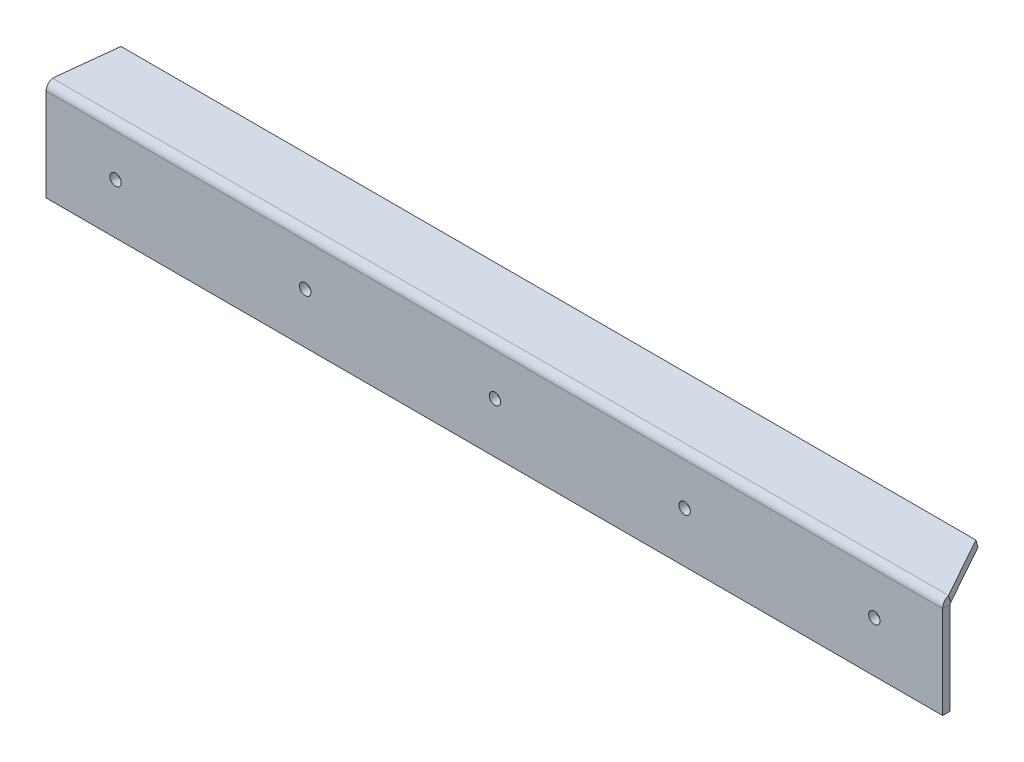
ISO-10303-21;
HEADER;
FILE_DESCRIPTION(('STEP AP214'),'2;1');
FILE_NAME('part.step','',(''),(''),'','','');
FILE_SCHEMA(('AUTOMOTIVE_DESIGN { 1 0 10303 214 1 1 1 1 }'));
ENDSEC;
DATA;
#1=APPLICATION_CONTEXT('core data for automotive mechanical design processes');
#2=APPLICATION_PROTOCOL_DEFINITION('international standard','automotive_design',2000,#1);
#3=PRODUCT_CONTEXT('',#1,'mechanical');
#4=PRODUCT('Part','Part','',(#3));
#5=PRODUCT_RELATED_PRODUCT_CATEGORY('part','',(#4));
#6=PRODUCT_DEFINITION_FORMATION('','',#4);
#7=PRODUCT_DEFINITION_CONTEXT('part definition',#1,'design');
#8=PRODUCT_DEFINITION('design','',#6,#7);
#9=PRODUCT_DEFINITION_SHAPE('','',#8);
#10=(LENGTH_UNIT() NAMED_UNIT(*) SI_UNIT(.MILLI.,.METRE.));
#11=(NAMED_UNIT(*) PLANE_ANGLE_UNIT() SI_UNIT($,.RADIAN.));
#12=(NAMED_UNIT(*) SI_UNIT($,.STERADIAN.) SOLID_ANGLE_UNIT());
#13=UNCERTAINTY_MEASURE_WITH_UNIT(LENGTH_MEASURE(1.E-05),#10,'distance_accuracy_value','');
#14=(GEOMETRIC_REPRESENTATION_CONTEXT(3) GLOBAL_UNCERTAINTY_ASSIGNED_CONTEXT((#13)) GLOBAL_UNIT_ASSIGNED_CONTEXT((#10,
#11,#12)) REPRESENTATION_CONTEXT('',''));
#15=CARTESIAN_POINT('',(0.,0.,0.));
#16=DIRECTION('',(0.,0.,1.));
#17=DIRECTION('',(1.,0.,0.));
#18=AXIS2_PLACEMENT_3D('',#15,#16,#17);
#19=CARTESIAN_POINT('',(-354.5,-80.,6.));
#20=DIRECTION('',(0.,0.,1.));
#21=DIRECTION('',(1.,0.,0.));
#22=AXIS2_PLACEMENT_3D('',#19,#20,#21);
#23=PLANE('',#22);
#24=CARTESIAN_POINT('',(300.5,-40.,6.));
#25=DIRECTION('',(0.,0.,1.));
#26=DIRECTION('',(1.,0.,0.));
#27=AXIS2_PLACEMENT_3D('',#24,#25,#26);
#28=CIRCLE('',#27,4.50000000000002);
#29=CARTESIAN_POINT('',(305.,-40.,6.));
#30=VERTEX_POINT('',#29);
#31=EDGE_CURVE('E327',#30,#30,#28,.T.);
#32=ORIENTED_EDGE('',*,*,#31,.F.);
#33=EDGE_LOOP('',(#32));
#34=FACE_BOUND('',#33,.T.);
#35=CARTESIAN_POINT('',(0.5,-40.,6.));
#36=DIRECTION('',(0.,0.,1.));
#37=DIRECTION('',(1.,0.,0.));
#38=AXIS2_PLACEMENT_3D('',#35,#36,#37);
#39=CIRCLE('',#38,4.50000000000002);
#40=CARTESIAN_POINT('',(5.00000000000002,-40.,6.));
#41=VERTEX_POINT('',#40);
#42=EDGE_CURVE('E316',#41,#41,#39,.T.);
#43=ORIENTED_EDGE('',*,*,#42,.F.);
#44=EDGE_LOOP('',(#43));
#45=FACE_BOUND('',#44,.T.);
#46=CARTESIAN_POINT('',(-299.5,-40.,6.));
#47=DIRECTION('',(0.,0.,1.));
#48=DIRECTION('',(1.,0.,0.));
#49=AXIS2_PLACEMENT_3D('',#46,#47,#48);
#50=CIRCLE('',#49,4.50000000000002);
#51=CARTESIAN_POINT('',(-295.,-40.,6.));
#52=VERTEX_POINT('',#51);
#53=EDGE_CURVE('E303',#52,#52,#50,.T.);
#54=ORIENTED_EDGE('',*,*,#53,.F.);
#55=EDGE_LOOP('',(#54));
#56=FACE_BOUND('',#55,.T.);
#57=CARTESIAN_POINT('',(-149.5,-40.,6.));
#58=DIRECTION('',(0.,0.,1.));
#59=DIRECTION('',(1.,0.,0.));
#60=AXIS2_PLACEMENT_3D('',#57,#58,#59);
#61=CIRCLE('',#60,4.50000000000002);
#62=CARTESIAN_POINT('',(-145.,-40.,6.));
#63=VERTEX_POINT('',#62);
#64=EDGE_CURVE('E310',#63,#63,#61,.T.);
#65=ORIENTED_EDGE('',*,*,#64,.F.);
#66=EDGE_LOOP('',(#65));
#67=FACE_BOUND('',#66,.T.);
#68=CARTESIAN_POINT('',(150.5,-40.,6.));
#69=DIRECTION('',(0.,0.,1.));
#70=DIRECTION('',(1.,0.,0.));
#71=AXIS2_PLACEMENT_3D('',#68,#69,#70);
#72=CIRCLE('',#71,4.50000000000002);
#73=CARTESIAN_POINT('',(155.,-40.,6.));
#74=VERTEX_POINT('',#73);
#75=EDGE_CURVE('E322',#74,#74,#72,.T.);
#76=ORIENTED_EDGE('',*,*,#75,.F.);
#77=EDGE_LOOP('',(#76));
#78=FACE_BOUND('',#77,.T.);
#79=DIRECTION('',(0.,1.,0.));
#80=VECTOR('',#79,1.);
#81=CARTESIAN_POINT('',(354.5,0.,6.));
#82=LINE('',#81,#80);
#83=CARTESIAN_POINT('',(354.5,-80.,6.));
#84=VERTEX_POINT('',#83);
#85=CARTESIAN_POINT('',(354.5,-6.79686452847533,5.99999999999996));
#86=VERTEX_POINT('',#85);
#87=EDGE_CURVE('E292',#84,#86,#82,.T.);
#88=ORIENTED_EDGE('',*,*,#87,.T.);
#89=DIRECTION('',(1.,0.,0.));
#90=VECTOR('',#89,1.);
#91=CARTESIAN_POINT('',(354.5,-6.79686452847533,5.99999999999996));
#92=LINE('',#91,#90);
#93=CARTESIAN_POINT('',(-354.5,-6.79686452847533,6.));
#94=VERTEX_POINT('',#93);
#95=EDGE_CURVE('E183',#86,#94,#92,.F.);
#96=ORIENTED_EDGE('',*,*,#95,.T.);
#97=DIRECTION('',(0.,-1.,0.));
#98=VECTOR('',#97,1.);
#99=CARTESIAN_POINT('',(-354.5,0.,6.));
#100=LINE('',#99,#98);
#101=CARTESIAN_POINT('',(-354.5,-80.,6.));
#102=VERTEX_POINT('',#101);
#103=EDGE_CURVE('E293',#94,#102,#100,.T.);
#104=ORIENTED_EDGE('',*,*,#103,.T.);
#105=DIRECTION('',(1.,0.,0.));
#106=VECTOR('',#105,1.);
#107=CARTESIAN_POINT('',(-354.5,-80.,6.));
#108=LINE('',#107,#106);
#109=EDGE_CURVE('E94',#102,#84,#108,.T.);
#110=ORIENTED_EDGE('',*,*,#109,.T.);
#111=EDGE_LOOP('',(#88,#96,#104,#110));
#112=FACE_BOUND('',#111,.T.);
#113=ADVANCED_FACE('F71',(#34,#45,#56,#67,#78,#112),#23,.T.);
#114=CARTESIAN_POINT('',(-354.5,-80.,0.));
#115=DIRECTION('',(0.,0.,1.));
#116=DIRECTION('',(1.,0.,0.));
#117=AXIS2_PLACEMENT_3D('',#114,#115,#116);
#118=PLANE('',#117);
#119=CARTESIAN_POINT('',(300.5,-40.,0.));
#120=DIRECTION('',(0.,0.,1.));
#121=DIRECTION('',(1.,0.,0.));
#122=AXIS2_PLACEMENT_3D('',#119,#120,#121);
#123=CIRCLE('',#122,4.50000000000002);
#124=CARTESIAN_POINT('',(305.,-40.,0.));
#125=VERTEX_POINT('',#124);
#126=EDGE_CURVE('E189',#125,#125,#123,.T.);
#127=ORIENTED_EDGE('',*,*,#126,.T.);
#128=EDGE_LOOP('',(#127));
#129=FACE_BOUND('',#128,.T.);
#130=CARTESIAN_POINT('',(0.5,-40.,0.));
#131=DIRECTION('',(0.,0.,1.));
#132=DIRECTION('',(1.,0.,0.));
#133=AXIS2_PLACEMENT_3D('',#130,#131,#132);
#134=CIRCLE('',#133,4.50000000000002);
#135=CARTESIAN_POINT('',(5.00000000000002,-40.,0.));
#136=VERTEX_POINT('',#135);
#137=EDGE_CURVE('E319',#136,#136,#134,.T.);
#138=ORIENTED_EDGE('',*,*,#137,.T.);
#139=EDGE_LOOP('',(#138));
#140=FACE_BOUND('',#139,.T.);
#141=CARTESIAN_POINT('',(-299.5,-40.,0.));
#142=DIRECTION('',(0.,0.,1.));
#143=DIRECTION('',(1.,0.,0.));
#144=AXIS2_PLACEMENT_3D('',#141,#142,#143);
#145=CIRCLE('',#144,4.50000000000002);
#146=CARTESIAN_POINT('',(-295.,-40.,0.));
#147=VERTEX_POINT('',#146);
#148=EDGE_CURVE('E305',#147,#147,#145,.T.);
#149=ORIENTED_EDGE('',*,*,#148,.T.);
#150=EDGE_LOOP('',(#149));
#151=FACE_BOUND('',#150,.T.);
#152=CARTESIAN_POINT('',(-149.5,-40.,0.));
#153=DIRECTION('',(0.,0.,1.));
#154=DIRECTION('',(1.,0.,0.));
#155=AXIS2_PLACEMENT_3D('',#152,#153,#154);
#156=CIRCLE('',#155,4.50000000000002);
#157=CARTESIAN_POINT('',(-145.,-40.,0.));
#158=VERTEX_POINT('',#157);
#159=EDGE_CURVE('E313',#158,#158,#156,.T.);
#160=ORIENTED_EDGE('',*,*,#159,.T.);
#161=EDGE_LOOP('',(#160));
#162=FACE_BOUND('',#161,.T.);
#163=CARTESIAN_POINT('',(150.5,-40.,0.));
#164=DIRECTION('',(0.,0.,1.));
#165=DIRECTION('',(1.,0.,0.));
#166=AXIS2_PLACEMENT_3D('',#163,#164,#165);
#167=CIRCLE('',#166,4.50000000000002);
#168=CARTESIAN_POINT('',(155.,-40.,0.));
#169=VERTEX_POINT('',#168);
#170=EDGE_CURVE('E325',#169,#169,#167,.T.);
#171=ORIENTED_EDGE('',*,*,#170,.T.);
#172=EDGE_LOOP('',(#171));
#173=FACE_BOUND('',#172,.T.);
#174=DIRECTION('',(1.,0.,0.));
#175=VECTOR('',#174,1.);
#176=CARTESIAN_POINT('',(354.5,-6.79686452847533,0.));
#177=LINE('',#176,#175);
#178=CARTESIAN_POINT('',(354.5,-6.79686452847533,0.));
#179=VERTEX_POINT('',#178);
#180=CARTESIAN_POINT('',(-354.5,-6.79686452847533,0.));
#181=VERTEX_POINT('',#180);
#182=EDGE_CURVE('E179',#179,#181,#177,.F.);
#183=ORIENTED_EDGE('',*,*,#182,.F.);
#184=DIRECTION('',(0.,1.,0.));
#185=VECTOR('',#184,1.);
#186=CARTESIAN_POINT('',(354.5,0.,0.));
#187=LINE('',#186,#185);
#188=CARTESIAN_POINT('',(354.5,-80.,0.));
#189=VERTEX_POINT('',#188);
#190=EDGE_CURVE('E287',#189,#179,#187,.T.);
#191=ORIENTED_EDGE('',*,*,#190,.F.);
#192=DIRECTION('',(1.,0.,0.));
#193=VECTOR('',#192,1.);
#194=CARTESIAN_POINT('',(-354.5,-80.,0.));
#195=LINE('',#194,#193);
#196=CARTESIAN_POINT('',(-354.5,-80.,0.));
#197=VERTEX_POINT('',#196);
#198=EDGE_CURVE('E280',#197,#189,#195,.T.);
#199=ORIENTED_EDGE('',*,*,#198,.F.);
#200=DIRECTION('',(0.,-1.,0.));
#201=VECTOR('',#200,1.);
#202=CARTESIAN_POINT('',(-354.5,0.,0.));
#203=LINE('',#202,#201);
#204=EDGE_CURVE('E288',#181,#197,#203,.T.);
#205=ORIENTED_EDGE('',*,*,#204,.F.);
#206=EDGE_LOOP('',(#183,#191,#199,#205));
#207=FACE_BOUND('',#206,.T.);
#208=ADVANCED_FACE('F265',(#129,#140,#151,#162,#173,#207),#118,.F.);
#209=CARTESIAN_POINT('',(-354.5,0.,6.));
#210=DIRECTION('',(1.,0.,0.));
#211=DIRECTION('',(0.,1.,0.));
#212=AXIS2_PLACEMENT_3D('',#209,#210,#211);
#213=PLANE('',#212);
#214=DIRECTION('',(0.,0.,1.));
#215=VECTOR('',#214,1.);
#216=CARTESIAN_POINT('',(-354.500000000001,-6.79686452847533,0.));
#217=LINE('',#216,#215);
#218=EDGE_CURVE('E187',#181,#94,#217,.T.);
#219=ORIENTED_EDGE('',*,*,#218,.F.);
#220=ORIENTED_EDGE('',*,*,#204,.T.);
#221=DIRECTION('',(0.,0.,-1.));
#222=VECTOR('',#221,1.);
#223=CARTESIAN_POINT('',(-354.5,-80.,6.));
#224=LINE('',#223,#222);
#225=EDGE_CURVE('E15',#102,#197,#224,.T.);
#226=ORIENTED_EDGE('',*,*,#225,.F.);
#227=ORIENTED_EDGE('',*,*,#103,.F.);
#228=EDGE_LOOP('',(#219,#220,#226,#227));
#229=FACE_BOUND('',#228,.T.);
#230=ADVANCED_FACE('F73',(#229),#213,.F.);
#231=CARTESIAN_POINT('',(354.5,0.,6.));
#232=DIRECTION('',(-1.,0.,0.));
#233=DIRECTION('',(0.,-1.,0.));
#234=AXIS2_PLACEMENT_3D('',#231,#232,#233);
#235=PLANE('',#234);
#236=DIRECTION('',(0.,0.,1.));
#237=VECTOR('',#236,1.);
#238=CARTESIAN_POINT('',(354.5,-6.79686452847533,0.));
#239=LINE('',#238,#237);
#240=EDGE_CURVE('E190',#179,#86,#239,.T.);
#241=ORIENTED_EDGE('',*,*,#240,.T.);
#242=ORIENTED_EDGE('',*,*,#87,.F.);
#243=DIRECTION('',(0.,0.,-1.));
#244=VECTOR('',#243,1.);
#245=CARTESIAN_POINT('',(354.5,-80.,6.));
#246=LINE('',#245,#244);
#247=EDGE_CURVE('E79',#84,#189,#246,.T.);
#248=ORIENTED_EDGE('',*,*,#247,.T.);
#249=ORIENTED_EDGE('',*,*,#190,.T.);
#250=EDGE_LOOP('',(#241,#242,#248,#249));
#251=FACE_BOUND('',#250,.T.);
#252=ADVANCED_FACE('F272',(#251),#235,.F.);
#253=CARTESIAN_POINT('',(-354.5,-80.,6.));
#254=DIRECTION('',(0.,1.,0.));
#255=DIRECTION('',(0.,0.,1.));
#256=AXIS2_PLACEMENT_3D('',#253,#254,#255);
#257=PLANE('',#256);
#258=ORIENTED_EDGE('',*,*,#198,.T.);
#259=ORIENTED_EDGE('',*,*,#247,.F.);
#260=ORIENTED_EDGE('',*,*,#109,.F.);
#261=ORIENTED_EDGE('',*,*,#225,.T.);
#262=EDGE_LOOP('',(#258,#259,#260,#261));
#263=FACE_BOUND('',#262,.T.);
#264=ADVANCED_FACE('F263',(#263),#257,.F.);
#265=CARTESIAN_POINT('',(-299.5,-40.,6.));
#266=DIRECTION('',(0.,0.,-1.));
#267=DIRECTION('',(-1.,0.,0.));
#268=AXIS2_PLACEMENT_3D('',#265,#266,#267);
#269=CYLINDRICAL_SURFACE('',#268,4.50000000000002);
#270=ORIENTED_EDGE('',*,*,#53,.T.);
#271=EDGE_LOOP('',(#270));
#272=FACE_BOUND('',#271,.T.);
#273=ORIENTED_EDGE('',*,*,#148,.F.);
#274=EDGE_LOOP('',(#273));
#275=FACE_BOUND('',#274,.T.);
#276=ADVANCED_FACE('F259',(#272,#275),#269,.F.);
#277=CARTESIAN_POINT('',(-149.5,-40.,6.));
#278=DIRECTION('',(0.,0.,-1.));
#279=DIRECTION('',(-1.,0.,0.));
#280=AXIS2_PLACEMENT_3D('',#277,#278,#279);
#281=CYLINDRICAL_SURFACE('',#280,4.50000000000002);
#282=ORIENTED_EDGE('',*,*,#64,.T.);
#283=EDGE_LOOP('',(#282));
#284=FACE_BOUND('',#283,.T.);
#285=ORIENTED_EDGE('',*,*,#159,.F.);
#286=EDGE_LOOP('',(#285));
#287=FACE_BOUND('',#286,.T.);
#288=ADVANCED_FACE('F255',(#284,#287),#281,.F.);
#289=CARTESIAN_POINT('',(0.5,-40.,6.));
#290=DIRECTION('',(0.,0.,-1.));
#291=DIRECTION('',(-1.,0.,0.));
#292=AXIS2_PLACEMENT_3D('',#289,#290,#291);
#293=CYLINDRICAL_SURFACE('',#292,4.50000000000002);
#294=ORIENTED_EDGE('',*,*,#42,.T.);
#295=EDGE_LOOP('',(#294));
#296=FACE_BOUND('',#295,.T.);
#297=ORIENTED_EDGE('',*,*,#137,.F.);
#298=EDGE_LOOP('',(#297));
#299=FACE_BOUND('',#298,.T.);
#300=ADVANCED_FACE('F251',(#296,#299),#293,.F.);
#301=CARTESIAN_POINT('',(150.5,-40.,6.));
#302=DIRECTION('',(0.,0.,-1.));
#303=DIRECTION('',(-1.,0.,0.));
#304=AXIS2_PLACEMENT_3D('',#301,#302,#303);
#305=CYLINDRICAL_SURFACE('',#304,4.50000000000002);
#306=ORIENTED_EDGE('',*,*,#75,.T.);
#307=EDGE_LOOP('',(#306));
#308=FACE_BOUND('',#307,.T.);
#309=ORIENTED_EDGE('',*,*,#170,.F.);
#310=EDGE_LOOP('',(#309));
#311=FACE_BOUND('',#310,.T.);
#312=ADVANCED_FACE('F247',(#308,#311),#305,.F.);
#313=CARTESIAN_POINT('',(300.5,-40.,6.));
#314=DIRECTION('',(0.,0.,-1.));
#315=DIRECTION('',(-1.,0.,0.));
#316=AXIS2_PLACEMENT_3D('',#313,#314,#315);
#317=CYLINDRICAL_SURFACE('',#316,4.50000000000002);
#318=ORIENTED_EDGE('',*,*,#31,.T.);
#319=EDGE_LOOP('',(#318));
#320=FACE_BOUND('',#319,.T.);
#321=ORIENTED_EDGE('',*,*,#126,.F.);
#322=EDGE_LOOP('',(#321));
#323=FACE_BOUND('',#322,.T.);
#324=ADVANCED_FACE('F238',(#320,#323),#317,.F.);
#325=CARTESIAN_POINT('',(-354.5,-6.79686452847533,6.06000000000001));
#326=CARTESIAN_POINT('',(-354.461789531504,-5.33194822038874,6.06000000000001));
#327=CARTESIAN_POINT('',(-354.42367816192,-3.87498634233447,5.57187207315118));
#328=CARTESIAN_POINT('',(-354.347356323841,-1.53815074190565,3.81094014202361));
#329=CARTESIAN_POINT('',(-354.309244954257,-0.667338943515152,2.54496478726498));
#330=CARTESIAN_POINT('',(-354.271034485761,-0.263553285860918,1.13679685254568));
#331=CARTESIAN_POINT('',(-354.5,-6.79686452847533,6.00000000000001));
#332=CARTESIAN_POINT('',(-354.461789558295,-5.34488052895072,6.00000000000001));
#333=CARTESIAN_POINT('',(-354.42367816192,-3.90078051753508,5.51618123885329));
#334=CARTESIAN_POINT('',(-354.347356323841,-1.58457436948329,3.77079471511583));
#335=CARTESIAN_POINT('',(-354.309244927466,-0.721450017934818,2.51599521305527));
#336=CARTESIAN_POINT('',(-354.271034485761,-0.321228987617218,1.12025861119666));
#337=CARTESIAN_POINT('',(-354.5,-6.79686452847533,0.));
#338=CARTESIAN_POINT('',(-354.461792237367,-6.63811138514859,0.));
#339=CARTESIAN_POINT('',(-354.42367816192,-6.48019803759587,-0.0529021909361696));
#340=CARTESIAN_POINT('',(-354.347356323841,-6.22693712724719,-0.243747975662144));
#341=CARTESIAN_POINT('',(-354.309242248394,-6.13255745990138,-0.380962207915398));
#342=CARTESIAN_POINT('',(-354.271034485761,-6.08879916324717,-0.533565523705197));
#343=CARTESIAN_POINT('',(-354.5,-6.79686452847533,-0.0605999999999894));
#344=CARTESIAN_POINT('',(-354.461792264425,-6.65117301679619,-0.0605999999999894));
#345=CARTESIAN_POINT('',(-354.42367816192,-6.50625015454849,-0.109149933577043));
#346=CARTESIAN_POINT('',(-354.347356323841,-6.27382499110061,-0.284294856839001));
#347=CARTESIAN_POINT('',(-354.309242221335,-6.18720964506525,-0.410221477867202));
#348=CARTESIAN_POINT('',(-354.271034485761,-6.14705162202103,-0.550269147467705));
#349=B_SPLINE_SURFACE_WITH_KNOTS('',1,3,((#325,#326,#327,#328,#329,#330),(#331,#332,#333,#334,
#335,#336),(#337,#338,#339,#340,#341,#342),(#343,#344,#345,#346,#347,#348)),.UNSPECIFIED.,.F.,
.F.,.F.,(2,1,1,2),(4,2,4),(-0.01,0.,1.,1.0101),(0.,0.5,1.),.UNSPECIFIED.);
#350=DIRECTION('',(0.,-0.961261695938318,-0.275637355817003));
#351=VECTOR('',#350,1.);
#352=CARTESIAN_POINT('',(-354.271034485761,-0.321228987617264,1.12025861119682));
#353=LINE('',#352,#351);
#354=CARTESIAN_POINT('',(-354.271034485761,-6.08879916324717,-0.533565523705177));
#355=VERTEX_POINT('',#354);
#356=CARTESIAN_POINT('',(-354.271034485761,-0.321228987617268,1.12025861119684));
#357=VERTEX_POINT('',#356);
#358=EDGE_CURVE('E161',#355,#357,#353,.F.);
#359=CARTESIAN_POINT('',(-354.5,-6.79686452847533,0.));
#360=CARTESIAN_POINT('',(-354.48988459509,-6.75485314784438,3.73960660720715E-05));
#361=CARTESIAN_POINT('',(-354.479773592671,-6.7128518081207,-0.00359184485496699));
#362=CARTESIAN_POINT('',(-354.459559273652,-6.63008398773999,-0.0179122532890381));
#363=CARTESIAN_POINT('',(-354.449455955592,-6.58931705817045,-0.0286008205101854));
#364=CARTESIAN_POINT('',(-354.429248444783,-6.51020013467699,-0.0567689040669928));
#365=CARTESIAN_POINT('',(-354.419144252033,-6.47185014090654,-0.0742484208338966));
#366=CARTESIAN_POINT('',(-354.39893137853,-6.39868422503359,-0.115476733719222));
#367=CARTESIAN_POINT('',(-354.38882269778,-6.36386830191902,-0.139225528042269));
#368=CARTESIAN_POINT('',(-354.36860595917,-6.29878727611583,-0.192300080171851));
#369=CARTESIAN_POINT('',(-354.358497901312,-6.26852217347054,-0.221625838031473));
#370=CARTESIAN_POINT('',(-354.338286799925,-6.21341925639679,-0.285009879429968));
#371=CARTESIAN_POINT('',(-354.328183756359,-6.18858140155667,-0.319068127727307));
#372=CARTESIAN_POINT('',(-354.310248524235,-6.1499634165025,-0.382821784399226));
#373=CARTESIAN_POINT('',(-354.302415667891,-6.13495265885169,-0.411780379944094));
#374=CARTESIAN_POINT('',(-354.286734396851,-6.10885690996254,-0.471474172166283));
#375=CARTESIAN_POINT('',(-354.278885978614,-6.09777873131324,-0.502212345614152));
#376=CARTESIAN_POINT('',(-354.271034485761,-6.08879916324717,-0.533565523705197));
#377=B_SPLINE_CURVE_WITH_KNOTS('',3,(#359,#360,#361,#362,#363,#364,#365,#366,#367,#368,#369,
#370,#371,#372,#373,#374,#375,#376),.UNSPECIFIED.,.F.,.F.,(4,2,2,2,2,2,2,2,4),(0.,
0.129468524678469,0.258889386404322,0.388310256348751,0.517731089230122,0.647151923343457,
0.776571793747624,0.87694014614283,0.977481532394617),.UNSPECIFIED.);
#378=EDGE_CURVE('E181',#181,#355,#377,.T.);
#379=CARTESIAN_POINT('',(-354.5,-6.79686452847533,6.00000000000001));
#380=CARTESIAN_POINT('',(-354.495012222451,-6.60734733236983,6.00002038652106));
#381=CARTESIAN_POINT('',(-354.490023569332,-6.41783310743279,5.99200347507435));
#382=CARTESIAN_POINT('',(-354.480046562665,-6.04016101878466,5.96004231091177));
#383=CARTESIAN_POINT('',(-354.475058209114,-5.85200309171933,5.93609880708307));
#384=CARTESIAN_POINT('',(-354.465085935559,-5.47847155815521,5.87244798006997));
#385=CARTESIAN_POINT('',(-354.460102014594,-5.29309657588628,5.83274873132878));
#386=CARTESIAN_POINT('',(-354.450135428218,-4.92635239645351,5.73787556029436));
#387=CARTESIAN_POINT('',(-354.445152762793,-4.74498314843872,5.68270183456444));
#388=CARTESIAN_POINT('',(-354.435186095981,-4.38749626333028,5.55725551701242));
#389=CARTESIAN_POINT('',(-354.430202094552,-4.21137985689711,5.48697941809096));
#390=CARTESIAN_POINT('',(-354.4202308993,-3.86563143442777,5.33180753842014));
#391=CARTESIAN_POINT('',(-354.415243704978,-3.69600184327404,5.24690635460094));
#392=CARTESIAN_POINT('',(-354.405270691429,-3.36461116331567,5.06316623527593));
#393=CARTESIAN_POINT('',(-354.400284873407,-3.2028450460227,4.96433636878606));
#394=CARTESIAN_POINT('',(-354.390312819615,-2.8881561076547,4.7533613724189));
#395=CARTESIAN_POINT('',(-354.38532658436,-2.73523654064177,4.64121138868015));
#396=CARTESIAN_POINT('',(-354.37535311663,-2.43940444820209,4.40443238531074));
#397=CARTESIAN_POINT('',(-354.370365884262,-2.29649115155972,4.27980432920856));
#398=CARTESIAN_POINT('',(-354.360392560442,-2.02167283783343,4.01894588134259));
#399=CARTESIAN_POINT('',(-354.355406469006,-1.88976798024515,3.88271532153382));
#400=CARTESIAN_POINT('',(-354.345435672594,-1.6379008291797,3.59961645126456));
#401=CARTESIAN_POINT('',(-354.340450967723,-1.51793927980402,3.45274747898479));
#402=CARTESIAN_POINT('',(-354.330482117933,-1.2908206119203,3.14941990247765));
#403=CARTESIAN_POINT('',(-354.325497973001,-1.18366300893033,2.99296166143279));
#404=CARTESIAN_POINT('',(-354.316390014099,-1.00025293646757,2.69933545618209));
#405=CARTESIAN_POINT('',(-354.312266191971,-0.92185857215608,2.56349914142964));
#406=CARTESIAN_POINT('',(-354.304017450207,-0.77473367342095,2.28669029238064));
#407=CARTESIAN_POINT('',(-354.299892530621,-0.706002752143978,2.14571796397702));
#408=CARTESIAN_POINT('',(-354.291645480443,-0.578602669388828,1.85945712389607));
#409=CARTESIAN_POINT('',(-354.287523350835,-0.519924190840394,1.71417275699));
#410=CARTESIAN_POINT('',(-354.279278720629,-0.412816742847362,1.41984961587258));
#411=CARTESIAN_POINT('',(-354.275156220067,-0.364389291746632,1.27081028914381));
#412=CARTESIAN_POINT('',(-354.271034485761,-0.321228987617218,1.12025861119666));
#413=B_SPLINE_CURVE_WITH_KNOTS('',3,(#379,#380,#381,#382,#383,#384,#385,#386,#387,#388,#389,
#390,#391,#392,#393,#394,#395,#396,#397,#398,#399,#400,#401,#402,#403,#404,#405,#406,#407,#408,
#409,#410,#411,#412),.UNSPECIFIED.,.F.,.F.,(4,2,2,2,2,2,2,2,2,2,2,2,2,2,2,2,4),(0.,
0.568574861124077,1.13712298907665,1.70538012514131,2.27363004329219,2.84201206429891,
3.41060451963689,3.97882845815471,4.5472600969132,5.11564787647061,5.68404388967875,
6.25247529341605,6.82088518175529,7.29118520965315,7.76146640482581,8.23130933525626,
8.70122180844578),.UNSPECIFIED.);
#414=EDGE_CURVE('E86',#94,#357,#413,.T.);
#415=ORIENTED_EDGE('',*,*,#358,.F.);
#416=ORIENTED_EDGE('',*,*,#378,.F.);
#417=ORIENTED_EDGE('',*,*,#218,.T.);
#418=ORIENTED_EDGE('',*,*,#414,.T.);
#419=EDGE_LOOP('',(#415,#416,#417,#418));
#420=FACE_BOUND('',#419,.T.);
#421=ADVANCED_FACE('F204',(#420),#349,.F.);
#422=CARTESIAN_POINT('',(354.271034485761,-0.263553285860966,1.1367968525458));
#423=CARTESIAN_POINT('',(354.309244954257,-0.667338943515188,2.54496478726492));
#424=CARTESIAN_POINT('',(354.347356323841,-1.53815074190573,3.81094014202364));
#425=CARTESIAN_POINT('',(354.42367816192,-3.87498634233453,5.57187207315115));
#426=CARTESIAN_POINT('',(354.461789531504,-5.33194822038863,6.05999999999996));
#427=CARTESIAN_POINT('',(354.5,-6.79686452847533,6.05999999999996));
#428=CARTESIAN_POINT('',(354.271034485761,-0.321228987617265,1.12025861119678));
#429=CARTESIAN_POINT('',(354.309244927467,-0.721450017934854,2.51599521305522));
#430=CARTESIAN_POINT('',(354.347356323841,-1.58457436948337,3.77079471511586));
#431=CARTESIAN_POINT('',(354.42367816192,-3.90078051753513,5.51618123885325));
#432=CARTESIAN_POINT('',(354.461789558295,-5.34488052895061,5.99999999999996));
#433=CARTESIAN_POINT('',(354.5,-6.79686452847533,5.99999999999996));
#434=CARTESIAN_POINT('',(354.271034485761,-6.08879916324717,-0.533565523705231));
#435=CARTESIAN_POINT('',(354.309242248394,-6.13255745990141,-0.380962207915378));
#436=CARTESIAN_POINT('',(354.347356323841,-6.2269371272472,-0.243747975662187));
#437=CARTESIAN_POINT('',(354.42367816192,-6.48019803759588,-0.0529021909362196));
#438=CARTESIAN_POINT('',(354.461792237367,-6.63811138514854,0.));
#439=CARTESIAN_POINT('',(354.5,-6.79686452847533,0.));
#440=CARTESIAN_POINT('',(354.271034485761,-6.14705162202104,-0.550269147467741));
#441=CARTESIAN_POINT('',(354.309242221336,-6.18720964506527,-0.410221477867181));
#442=CARTESIAN_POINT('',(354.347356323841,-6.27382499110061,-0.284294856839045));
#443=CARTESIAN_POINT('',(354.42367816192,-6.50625015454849,-0.109149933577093));
#444=CARTESIAN_POINT('',(354.461792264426,-6.65117301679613,-0.0606000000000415));
#445=CARTESIAN_POINT('',(354.5,-6.79686452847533,-0.0606000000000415));
#446=B_SPLINE_SURFACE_WITH_KNOTS('',1,3,((#422,#423,#424,#425,#426,#427),(#428,#429,#430,#431,
#432,#433),(#434,#435,#436,#437,#438,#439),(#440,#441,#442,#443,#444,#445)),.UNSPECIFIED.,.F.,
.F.,.F.,(2,1,1,2),(4,2,4),(-0.01,0.,1.,1.0101),(0.,0.5,1.),.UNSPECIFIED.);
#447=CARTESIAN_POINT('',(354.271034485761,-6.08879916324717,-0.533565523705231));
#448=CARTESIAN_POINT('',(354.281149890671,-6.10034312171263,-0.493171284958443));
#449=CARTESIAN_POINT('',(354.29126089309,-6.11540891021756,-0.45379736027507));
#450=CARTESIAN_POINT('',(354.31147521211,-6.1519884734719,-0.378183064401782));
#451=CARTESIAN_POINT('',(354.321578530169,-6.17349987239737,-0.341941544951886));
#452=CARTESIAN_POINT('',(354.341786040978,-6.22238435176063,-0.273653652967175));
#453=CARTESIAN_POINT('',(354.351890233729,-6.24975743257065,-0.241607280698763));
#454=CARTESIAN_POINT('',(354.372103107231,-6.30955589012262,-0.182639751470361));
#455=CARTESIAN_POINT('',(354.382211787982,-6.34198126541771,-0.155718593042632));
#456=CARTESIAN_POINT('',(354.402428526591,-6.41093856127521,-0.107788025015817));
#457=CARTESIAN_POINT('',(354.412536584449,-6.44747048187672,-0.0867786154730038));
#458=CARTESIAN_POINT('',(354.432747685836,-6.52358755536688,-0.0512813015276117));
#459=CARTESIAN_POINT('',(354.442850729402,-6.56317268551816,-0.0367933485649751));
#460=CARTESIAN_POINT('',(354.460785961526,-6.63510119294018,-0.0172442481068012));
#461=CARTESIAN_POINT('',(354.46861881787,-6.6670755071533,-0.0107970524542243));
#462=CARTESIAN_POINT('',(354.48430008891,-6.73164982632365,-0.0021660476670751));
#463=CARTESIAN_POINT('',(354.492148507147,-6.76425081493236,1.03922774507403E-05));
#464=CARTESIAN_POINT('',(354.5,-6.79686452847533,0.));
#465=B_SPLINE_CURVE_WITH_KNOTS('',3,(#447,#448,#449,#450,#451,#452,#453,#454,#455,#456,#457,
#458,#459,#460,#461,#462,#463,#464),.UNSPECIFIED.,.F.,.F.,(4,2,2,2,2,2,2,2,4),(0.,
0.129468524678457,0.258889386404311,0.388310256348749,0.517731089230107,0.647151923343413,
0.776571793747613,0.876940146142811,0.977481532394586),.UNSPECIFIED.);
#466=CARTESIAN_POINT('',(354.271034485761,-6.08879916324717,-0.533565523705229));
#467=VERTEX_POINT('',#466);
#468=EDGE_CURVE('E182',#467,#179,#465,.T.);
#469=DIRECTION('',(0.,-0.961261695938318,-0.275637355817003));
#470=VECTOR('',#469,1.);
#471=CARTESIAN_POINT('',(354.271034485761,-6.08879916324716,-0.533565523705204));
#472=LINE('',#471,#470);
#473=CARTESIAN_POINT('',(354.271034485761,-0.321228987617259,1.1202586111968));
#474=VERTEX_POINT('',#473);
#475=EDGE_CURVE('E173',#467,#474,#472,.F.);
#476=CARTESIAN_POINT('',(354.271034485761,-0.321228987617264,1.12025861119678));
#477=CARTESIAN_POINT('',(354.27602226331,-0.373447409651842,1.30243985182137));
#478=CARTESIAN_POINT('',(354.281010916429,-0.43339095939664,1.4824028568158));
#479=CARTESIAN_POINT('',(354.290987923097,-0.568214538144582,1.83663487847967));
#480=CARTESIAN_POINT('',(354.295976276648,-0.643093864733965,2.01090416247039));
#481=CARTESIAN_POINT('',(354.305948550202,-0.80723821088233,2.35242117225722));
#482=CARTESIAN_POINT('',(354.310932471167,-0.896495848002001,2.51967244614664));
#483=CARTESIAN_POINT('',(354.320899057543,-1.08878218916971,2.84605898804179));
#484=CARTESIAN_POINT('',(354.325881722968,-1.19181071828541,3.00519435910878));
#485=CARTESIAN_POINT('',(354.33584838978,-1.41093419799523,3.3142551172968));
#486=CARTESIAN_POINT('',(354.340832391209,-1.52703218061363,3.46417835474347));
#487=CARTESIAN_POINT('',(354.350803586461,-1.77149414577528,3.75376190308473));
#488=CARTESIAN_POINT('',(354.355790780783,-1.89986265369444,3.89341839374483));
#489=CARTESIAN_POINT('',(354.365763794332,-2.16782864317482,4.16132592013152));
#490=CARTESIAN_POINT('',(354.370749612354,-2.30741879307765,4.28958428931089));
#491=CARTESIAN_POINT('',(354.380721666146,-2.59696100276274,4.5339301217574));
#492=CARTESIAN_POINT('',(354.385707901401,-2.74691683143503,4.65001311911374));
#493=CARTESIAN_POINT('',(354.395681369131,-3.05606579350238,4.86912003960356));
#494=CARTESIAN_POINT('',(354.400668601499,-3.21525821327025,4.97214496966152));
#495=CARTESIAN_POINT('',(354.41064192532,-3.54176164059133,5.16441495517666));
#496=CARTESIAN_POINT('',(354.415628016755,-3.70907276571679,5.25365981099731));
#497=CARTESIAN_POINT('',(354.425598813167,-4.05062886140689,5.41773743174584));
#498=CARTESIAN_POINT('',(354.430583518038,-4.22487426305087,5.49256929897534));
#499=CARTESIAN_POINT('',(354.440552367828,-4.57905383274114,5.6272813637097));
#500=CARTESIAN_POINT('',(354.44553651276,-4.75898778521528,5.68716212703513));
#501=CARTESIAN_POINT('',(354.454644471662,-5.09179407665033,5.78253285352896));
#502=CARTESIAN_POINT('',(354.45876829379,-5.24397673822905,5.82044879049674));
#503=CARTESIAN_POINT('',(354.467017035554,-5.55061559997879,5.88557546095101));
#504=CARTESIAN_POINT('',(354.47114195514,-5.70507170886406,5.91278662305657));
#505=CARTESIAN_POINT('',(354.479389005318,-6.01535951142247,5.9563472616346));
#506=CARTESIAN_POINT('',(354.483511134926,-6.17118978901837,5.97270683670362));
#507=CARTESIAN_POINT('',(354.491755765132,-6.48363416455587,5.99453867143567));
#508=CARTESIAN_POINT('',(354.495878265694,-6.64024837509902,6.00000931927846));
#509=CARTESIAN_POINT('',(354.5,-6.79686452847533,5.99999999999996));
#510=B_SPLINE_CURVE_WITH_KNOTS('',3,(#476,#477,#478,#479,#480,#481,#482,#483,#484,#485,#486,
#487,#488,#489,#490,#491,#492,#493,#494,#495,#496,#497,#498,#499,#500,#501,#502,#503,#504,#505,
#506,#507,#508,#509),.UNSPECIFIED.,.F.,.F.,(4,2,2,2,2,2,2,2,2,2,2,2,2,2,2,2,4),(0.,
0.568574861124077,1.13712298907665,1.70538012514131,2.27363004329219,2.84201206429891,
3.41060451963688,3.9788284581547,4.54726009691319,5.1156478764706,5.68404388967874,
6.25247529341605,6.82088518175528,7.2911852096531,7.76146640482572,8.23130933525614,
8.70122180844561),.UNSPECIFIED.);
#511=EDGE_CURVE('E186',#474,#86,#510,.T.);
#512=ORIENTED_EDGE('',*,*,#468,.F.);
#513=ORIENTED_EDGE('',*,*,#475,.T.);
#514=ORIENTED_EDGE('',*,*,#511,.T.);
#515=ORIENTED_EDGE('',*,*,#240,.F.);
#516=EDGE_LOOP('',(#512,#513,#514,#515));
#517=FACE_BOUND('',#516,.T.);
#518=ADVANCED_FACE('F213',(#517),#446,.F.);
#519=CARTESIAN_POINT('',(354.5,-6.79686452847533,-0.736600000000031));
#520=DIRECTION('',(1.,0.,0.));
#521=DIRECTION('',(0.,0.961261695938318,0.275637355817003));
#522=AXIS2_PLACEMENT_3D('',#519,#520,#521);
#523=CYLINDRICAL_SURFACE('',#522,6.73659999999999);
#524=ORIENTED_EDGE('',*,*,#95,.F.);
#525=ORIENTED_EDGE('',*,*,#511,.F.);
#526=DIRECTION('',(1.,0.,0.));
#527=VECTOR('',#526,1.);
#528=CARTESIAN_POINT('',(-354.271034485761,-0.321228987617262,1.12025861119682));
#529=LINE('',#528,#527);
#530=EDGE_CURVE('E171',#474,#357,#529,.F.);
#531=ORIENTED_EDGE('',*,*,#530,.T.);
#532=ORIENTED_EDGE('',*,*,#414,.F.);
#533=EDGE_LOOP('',(#524,#525,#531,#532));
#534=FACE_BOUND('',#533,.T.);
#535=ADVANCED_FACE('F208',(#534),#523,.T.);
#536=CARTESIAN_POINT('',(354.5,-6.79686452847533,-0.736600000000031));
#537=DIRECTION('',(1.,0.,0.));
#538=DIRECTION('',(0.,0.961261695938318,0.275637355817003));
#539=AXIS2_PLACEMENT_3D('',#536,#537,#538);
#540=CYLINDRICAL_SURFACE('',#539,0.736599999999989);
#541=ORIENTED_EDGE('',*,*,#182,.T.);
#542=ORIENTED_EDGE('',*,*,#378,.T.);
#543=DIRECTION('',(1.,0.,0.));
#544=VECTOR('',#543,1.);
#545=CARTESIAN_POINT('',(-354.271034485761,-6.08879916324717,-0.533565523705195));
#546=LINE('',#545,#544);
#547=EDGE_CURVE('E176',#355,#467,#546,.T.);
#548=ORIENTED_EDGE('',*,*,#547,.T.);
#549=ORIENTED_EDGE('',*,*,#468,.T.);
#550=EDGE_LOOP('',(#541,#542,#548,#549));
#551=FACE_BOUND('',#550,.T.);
#552=ADVANCED_FACE('F212',(#551),#540,.F.);
#553=CARTESIAN_POINT('',(354.5,-0.474226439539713,1.65382413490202));
#554=DIRECTION('',(-0.924438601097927,-0.105109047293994,0.366558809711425));
#555=DIRECTION('',(0.368600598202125,0.,0.929587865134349));
#556=AXIS2_PLACEMENT_3D('',#553,#554,#555);
#557=PLANE('',#556);
#558=ORIENTED_EDGE('',*,*,#475,.F.);
#559=DIRECTION('',(0.381330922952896,-0.254809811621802,0.88862741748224));
#560=VECTOR('',#559,1.);
#561=CARTESIAN_POINT('',(354.5,-6.24179661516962,0.));
#562=LINE('',#561,#560);
#563=CARTESIAN_POINT('',(338.,4.78369761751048,-38.4504678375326));
#564=VERTEX_POINT('',#563);
#565=EDGE_CURVE('E169',#467,#564,#562,.F.);
#566=ORIENTED_EDGE('',*,*,#565,.T.);
#567=DIRECTION('',(0.,-0.961261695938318,-0.275637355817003));
#568=VECTOR('',#567,1.);
#569=CARTESIAN_POINT('',(338.,10.5512677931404,-36.7966437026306));
#570=LINE('',#569,#568);
#571=CARTESIAN_POINT('',(338.,10.5512677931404,-36.7966437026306));
#572=VERTEX_POINT('',#571);
#573=EDGE_CURVE('E157',#572,#564,#570,.T.);
#574=ORIENTED_EDGE('',*,*,#573,.F.);
#575=DIRECTION('',(-0.381330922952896,0.254809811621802,-0.88862741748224));
#576=VECTOR('',#575,1.);
#577=CARTESIAN_POINT('',(338.,10.5512677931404,-36.7966437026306));
#578=LINE('',#577,#576);
#579=EDGE_CURVE('E144',#474,#572,#578,.T.);
#580=ORIENTED_EDGE('',*,*,#579,.F.);
#581=EDGE_LOOP('',(#558,#566,#574,#580));
#582=FACE_BOUND('',#581,.T.);
#583=ADVANCED_FACE('F218',(#582),#557,.F.);
#584=CARTESIAN_POINT('',(-354.5,-0.474226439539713,1.65382413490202));
#585=DIRECTION('',(0.924438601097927,-0.105109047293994,0.366558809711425));
#586=DIRECTION('',(0.368600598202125,0.,-0.929587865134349));
#587=AXIS2_PLACEMENT_3D('',#584,#585,#586);
#588=PLANE('',#587);
#589=ORIENTED_EDGE('',*,*,#358,.T.);
#590=DIRECTION('',(-0.381330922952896,-0.254809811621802,0.88862741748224));
#591=VECTOR('',#590,1.);
#592=CARTESIAN_POINT('',(-239.700627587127,76.2360655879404,-265.866756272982));
#593=LINE('',#592,#591);
#594=CARTESIAN_POINT('',(-338.,10.5512677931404,-36.7966437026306));
#595=VERTEX_POINT('',#594);
#596=EDGE_CURVE('E142',#595,#357,#593,.T.);
#597=ORIENTED_EDGE('',*,*,#596,.F.);
#598=DIRECTION('',(0.,-0.961261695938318,-0.275637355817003));
#599=VECTOR('',#598,1.);
#600=CARTESIAN_POINT('',(-338.,10.5512677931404,-36.7966437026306));
#601=LINE('',#600,#599);
#602=CARTESIAN_POINT('',(-338.,4.78369761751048,-38.4504678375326));
#603=VERTEX_POINT('',#602);
#604=EDGE_CURVE('E150',#595,#603,#601,.T.);
#605=ORIENTED_EDGE('',*,*,#604,.T.);
#606=DIRECTION('',(0.381330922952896,0.254809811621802,-0.88862741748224));
#607=VECTOR('',#606,1.);
#608=CARTESIAN_POINT('',(-354.5,-6.24179661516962,0.));
#609=LINE('',#608,#607);
#610=EDGE_CURVE('E166',#603,#355,#609,.F.);
#611=ORIENTED_EDGE('',*,*,#610,.T.);
#612=EDGE_LOOP('',(#589,#597,#605,#611));
#613=FACE_BOUND('',#612,.T.);
#614=ADVANCED_FACE('F160',(#613),#588,.F.);
#615=CARTESIAN_POINT('',(338.,10.5512677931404,-36.7966437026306));
#616=DIRECTION('',(0.,-0.961261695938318,-0.275637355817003));
#617=DIRECTION('',(0.,0.275637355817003,-0.961261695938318));
#618=AXIS2_PLACEMENT_3D('',#615,#616,#617);
#619=PLANE('',#618);
#620=ORIENTED_EDGE('',*,*,#530,.F.);
#621=ORIENTED_EDGE('',*,*,#579,.T.);
#622=DIRECTION('',(-1.,0.,0.));
#623=VECTOR('',#622,1.);
#624=CARTESIAN_POINT('',(338.,10.5512677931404,-36.7966437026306));
#625=LINE('',#624,#623);
#626=EDGE_CURVE('E137',#572,#595,#625,.T.);
#627=ORIENTED_EDGE('',*,*,#626,.T.);
#628=ORIENTED_EDGE('',*,*,#596,.T.);
#629=EDGE_LOOP('',(#620,#621,#627,#628));
#630=FACE_BOUND('',#629,.T.);
#631=ADVANCED_FACE('F140',(#630),#619,.F.);
#632=CARTESIAN_POINT('',(338.,4.78369761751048,-38.4504678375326));
#633=DIRECTION('',(0.,-0.961261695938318,-0.275637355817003));
#634=DIRECTION('',(0.,0.275637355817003,-0.961261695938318));
#635=AXIS2_PLACEMENT_3D('',#632,#633,#634);
#636=PLANE('',#635);
#637=ORIENTED_EDGE('',*,*,#565,.F.);
#638=ORIENTED_EDGE('',*,*,#547,.F.);
#639=ORIENTED_EDGE('',*,*,#610,.F.);
#640=DIRECTION('',(1.,0.,0.));
#641=VECTOR('',#640,1.);
#642=CARTESIAN_POINT('',(-338.,4.78369761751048,-38.4504678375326));
#643=LINE('',#642,#641);
#644=EDGE_CURVE('E153',#564,#603,#643,.F.);
#645=ORIENTED_EDGE('',*,*,#644,.F.);
#646=EDGE_LOOP('',(#637,#638,#639,#645));
#647=FACE_BOUND('',#646,.T.);
#648=ADVANCED_FACE('F362',(#647),#636,.T.);
#649=CARTESIAN_POINT('',(-338.,10.5512677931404,-36.7966437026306));
#650=DIRECTION('',(0.,-0.275637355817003,0.961261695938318));
#651=DIRECTION('',(0.,-0.961261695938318,-0.275637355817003));
#652=AXIS2_PLACEMENT_3D('',#649,#650,#651);
#653=PLANE('',#652);
#654=ORIENTED_EDGE('',*,*,#644,.T.);
#655=ORIENTED_EDGE('',*,*,#604,.F.);
#656=ORIENTED_EDGE('',*,*,#626,.F.);
#657=ORIENTED_EDGE('',*,*,#573,.T.);
#658=EDGE_LOOP('',(#654,#655,#656,#657));
#659=FACE_BOUND('',#658,.T.);
#660=ADVANCED_FACE('F151',(#659),#653,.F.);
#661=CLOSED_SHELL('',(#113,#208,#230,#252,#264,#276,#288,#300,#312,#324,#421,#518,#535,#552,
#583,#614,#631,#648,#660));
#662=MANIFOLD_SOLID_BREP('B2',#661);
#663=ADVANCED_BREP_SHAPE_REPRESENTATION('',(#18,#662),#14);
#664=SHAPE_DEFINITION_REPRESENTATION(#9,#663);
ENDSEC;
END-ISO-10303-21;
